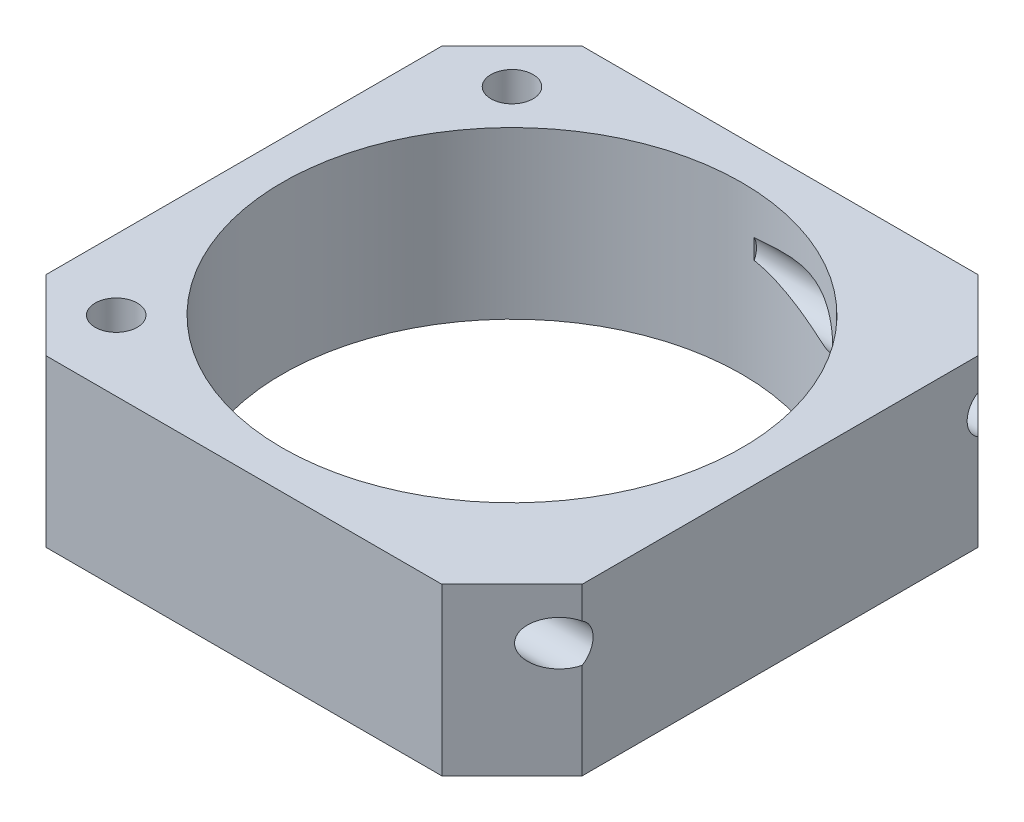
from build123d import *

# Parameters (mm, degrees)
SKETCH1_W           = 42
SKETCH1_H           = 42
SKETCH1_R           = 1.65
SKETCH1_R_2         = 18
BOSS_EXTRUDE1_DEPTH = 13
CHAMFER1_SIZE       = 5.5
SKETCH3_R           = 1.75
CUT_EXTRUDE2_DEPTH  = 20
SKETCH4_R           = 1.75
CUT_EXTRUDE3_DEPTH  = 20


with BuildPart() as part:
    # Sketch1 → Boss-Extrude1 (new body)
    with BuildSketch(Plane(origin=(0, 0, 0), x_dir=(1, 0, 0), z_dir=(0, 1, 0))):
        with Locations((21, 21)):
            Rectangle(SKETCH1_W, SKETCH1_H)
        with Locations(Location((5.5, 36.5, 0), (0, 0, 90))):
            Circle(SKETCH1_R, mode=Mode.SUBTRACT)
        with Locations(Location((5.5, 5.5, 0), (0, 0, 90))):
            Circle(SKETCH1_R, mode=Mode.SUBTRACT)
        with Locations(Location((21, 21, 0), (0, 0, 90))):
            Circle(SKETCH1_R_2, mode=Mode.SUBTRACT)
    extrude(amount=BOSS_EXTRUDE1_DEPTH)

    # Chamfer1
    chamfer1_edges = [part.edges().sort_by_distance(p)[0] for p in [
        (0, 6.5, -42),
        (42, 6.5, -42),
        (42, 6.5, 0),
        (0, 6.5, 0),
    ]]
    chamfer(chamfer1_edges, length=CHAMFER1_SIZE)

    # Sketch3 → Cut-Extrude2 (cut)
    with BuildSketch(Plane(origin=(42, 0, 0), x_dir=(0, 0, -1), z_dir=(1, 0, 0))):
        with Locations(Location((37.4, 9, 0), (0, 0, 333.948601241))):
            Circle(SKETCH3_R)
    extrude(amount=-CUT_EXTRUDE2_DEPTH, mode=Mode.SUBTRACT)

    # Sketch4 → Cut-Extrude3 (cut)
    with BuildSketch(Plane(origin=(42, 0, 0), x_dir=(0, 0, -1), z_dir=(1, 0, 0))):
        with Locations(Location((4.6, 9, 0), (0, 0, 300.949723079))):
            Circle(SKETCH4_R)
    extrude(amount=-CUT_EXTRUDE3_DEPTH, mode=Mode.SUBTRACT)


solid = part.part
